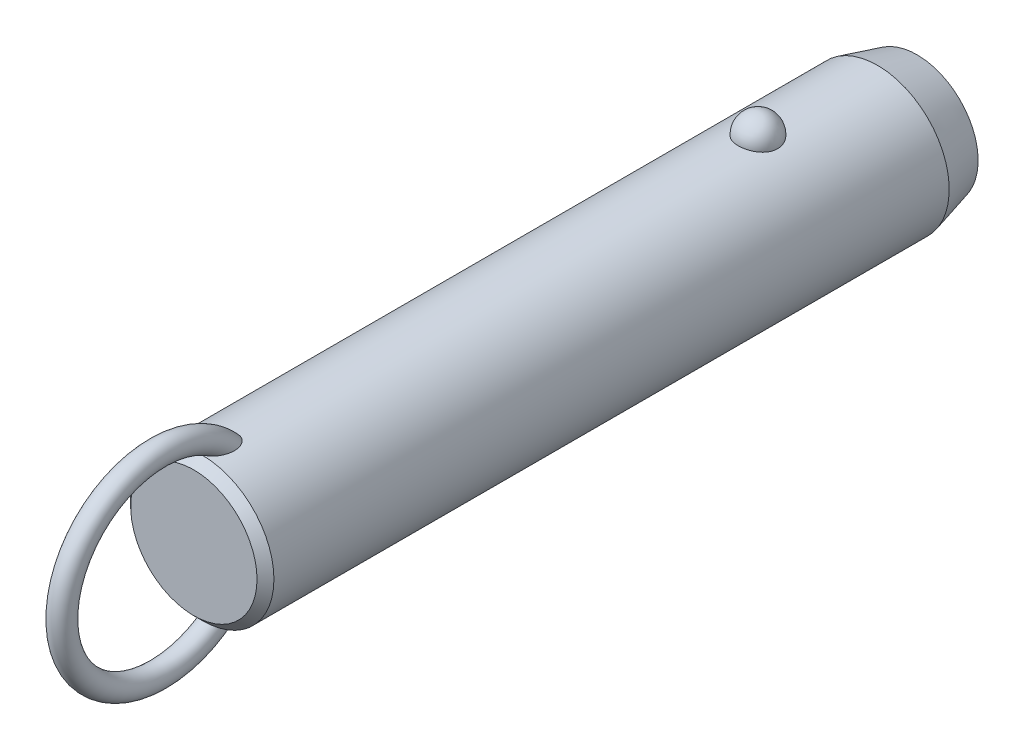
ISO-10303-21;
HEADER;
FILE_DESCRIPTION(('STEP AP214'),'2;1');
FILE_NAME('part.step','',(''),(''),'','','');
FILE_SCHEMA(('AUTOMOTIVE_DESIGN { 1 0 10303 214 1 1 1 1 }'));
ENDSEC;
DATA;
#1=APPLICATION_CONTEXT('core data for automotive mechanical design processes');
#2=APPLICATION_PROTOCOL_DEFINITION('international standard','automotive_design',2000,#1);
#3=PRODUCT_CONTEXT('',#1,'mechanical');
#4=PRODUCT('Part','Part','',(#3));
#5=PRODUCT_RELATED_PRODUCT_CATEGORY('part','',(#4));
#6=PRODUCT_DEFINITION_FORMATION('','',#4);
#7=PRODUCT_DEFINITION_CONTEXT('part definition',#1,'design');
#8=PRODUCT_DEFINITION('design','',#6,#7);
#9=PRODUCT_DEFINITION_SHAPE('','',#8);
#10=(LENGTH_UNIT() NAMED_UNIT(*) SI_UNIT(.MILLI.,.METRE.));
#11=(NAMED_UNIT(*) PLANE_ANGLE_UNIT() SI_UNIT($,.RADIAN.));
#12=(NAMED_UNIT(*) SI_UNIT($,.STERADIAN.) SOLID_ANGLE_UNIT());
#13=UNCERTAINTY_MEASURE_WITH_UNIT(LENGTH_MEASURE(1.E-05),#10,'distance_accuracy_value','');
#14=(GEOMETRIC_REPRESENTATION_CONTEXT(3) GLOBAL_UNCERTAINTY_ASSIGNED_CONTEXT((#13)) GLOBAL_UNIT_ASSIGNED_CONTEXT((#10,
#11,#12)) REPRESENTATION_CONTEXT('',''));
#15=CARTESIAN_POINT('',(0.,0.,0.));
#16=DIRECTION('',(0.,0.,1.));
#17=DIRECTION('',(1.,0.,0.));
#18=AXIS2_PLACEMENT_3D('',#15,#16,#17);
#19=CARTESIAN_POINT('',(0.,0.,83.8));
#20=DIRECTION('',(0.,0.,-1.));
#21=DIRECTION('',(-1.,0.,0.));
#22=AXIS2_PLACEMENT_3D('',#19,#20,#21);
#23=CYLINDRICAL_SURFACE('',#22,12.7);
#24=CARTESIAN_POINT('',(3.46661256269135,12.2177165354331,-3.5));
#25=CARTESIAN_POINT('',(3.4666090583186,12.2177194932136,-3.30432790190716));
#26=CARTESIAN_POINT('',(3.45063567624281,12.2222841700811,-3.10861112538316));
#27=CARTESIAN_POINT('',(3.38712451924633,12.2400345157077,-2.72271899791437));
#28=CARTESIAN_POINT('',(3.33957415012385,12.2532236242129,-2.53254588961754));
#29=CARTESIAN_POINT('',(3.2141234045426,12.286724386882,-2.16324948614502));
#30=CARTESIAN_POINT('',(3.13623639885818,12.3070329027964,-1.98412136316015));
#31=CARTESIAN_POINT('',(2.95205930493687,12.3525018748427,-1.64180592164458));
#32=CARTESIAN_POINT('',(2.84577003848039,12.3776621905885,-1.47861814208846));
#33=CARTESIAN_POINT('',(2.60688050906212,12.4301712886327,-1.17190583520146));
#34=CARTESIAN_POINT('',(2.47415697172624,12.4575299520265,-1.02847897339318));
#35=CARTESIAN_POINT('',(2.18615174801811,12.5112810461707,-0.766177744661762));
#36=CARTESIAN_POINT('',(2.03087002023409,12.5376734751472,-0.64730342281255));
#37=CARTESIAN_POINT('',(1.70237334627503,12.5864761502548,-0.437732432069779));
#38=CARTESIAN_POINT('',(1.52920948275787,12.6088972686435,-0.346958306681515));
#39=CARTESIAN_POINT('',(1.16944170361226,12.6473352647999,-0.195750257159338));
#40=CARTESIAN_POINT('',(0.982839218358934,12.663352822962,-0.135313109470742));
#41=CARTESIAN_POINT('',(0.604961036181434,12.6869706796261,-0.0473241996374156));
#42=CARTESIAN_POINT('',(0.41382314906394,12.6947125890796,-0.0192185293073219));
#43=CARTESIAN_POINT('',(0.0293827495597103,12.7014203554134,0.0051725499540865));
#44=CARTESIAN_POINT('',(-0.163919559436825,12.7003870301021,0.00146092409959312));
#45=CARTESIAN_POINT('',(-0.544374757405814,12.689735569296,-0.0373939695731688));
#46=CARTESIAN_POINT('',(-0.731575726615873,12.6802364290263,-0.0721015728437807));
#47=CARTESIAN_POINT('',(-1.09733277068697,12.6538333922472,-0.171364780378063));
#48=CARTESIAN_POINT('',(-1.27588869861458,12.6369293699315,-0.235920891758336));
#49=CARTESIAN_POINT('',(-1.6204698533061,12.5973946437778,-0.393548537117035));
#50=CARTESIAN_POINT('',(-1.78641865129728,12.5747321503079,-0.486778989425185));
#51=CARTESIAN_POINT('',(-2.10030671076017,12.5261316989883,-0.699110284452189));
#52=CARTESIAN_POINT('',(-2.24824419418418,12.5001934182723,-0.818213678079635));
#53=CARTESIAN_POINT('',(-2.52491489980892,12.4472906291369,-1.08157124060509));
#54=CARTESIAN_POINT('',(-2.65324222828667,12.4203160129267,-1.22624992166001));
#55=CARTESIAN_POINT('',(-2.88410007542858,12.3687509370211,-1.53528325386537));
#56=CARTESIAN_POINT('',(-2.98662883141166,12.3441606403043,-1.69963924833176));
#57=CARTESIAN_POINT('',(-3.16432417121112,12.2998199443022,-2.04548497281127));
#58=CARTESIAN_POINT('',(-3.23917525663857,12.2801261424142,-2.22714424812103));
#59=CARTESIAN_POINT('',(-3.35800573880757,12.248167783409,-2.6009138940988));
#60=CARTESIAN_POINT('',(-3.4019860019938,12.2359030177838,-2.79302397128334));
#61=CARTESIAN_POINT('',(-3.45784812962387,12.2202347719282,-3.18140279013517));
#62=CARTESIAN_POINT('',(-3.46986123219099,12.2167950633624,-3.37765118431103));
#63=CARTESIAN_POINT('',(-3.46186273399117,12.2190638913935,-3.76943689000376));
#64=CARTESIAN_POINT('',(-3.44185196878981,12.2247721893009,-3.96497421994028));
#65=CARTESIAN_POINT('',(-3.37048652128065,12.2446381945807,-4.34881728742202));
#66=CARTESIAN_POINT('',(-3.31928253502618,12.2587552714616,-4.53715319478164));
#67=CARTESIAN_POINT('',(-3.18693461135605,12.2938237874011,-4.90231727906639));
#68=CARTESIAN_POINT('',(-3.1057895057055,12.3147754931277,-5.07914500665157));
#69=CARTESIAN_POINT('',(-2.91506431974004,12.3613125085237,-5.41732059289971));
#70=CARTESIAN_POINT('',(-2.80533587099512,12.3869217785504,-5.57858147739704));
#71=CARTESIAN_POINT('',(-2.560414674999,12.4398525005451,-5.88013283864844));
#72=CARTESIAN_POINT('',(-2.42522099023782,12.4671740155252,-6.02042254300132));
#73=CARTESIAN_POINT('',(-2.1323357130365,12.5205965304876,-6.27662798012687));
#74=CARTESIAN_POINT('',(-1.97456596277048,12.5466928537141,-6.3924554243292));
#75=CARTESIAN_POINT('',(-1.64115839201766,12.5946384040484,-6.59583547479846));
#76=CARTESIAN_POINT('',(-1.46552179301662,12.6164879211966,-6.68339001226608));
#77=CARTESIAN_POINT('',(-1.10356050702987,12.6532533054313,-6.82682153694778));
#78=CARTESIAN_POINT('',(-0.9173913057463,12.6682500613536,-6.8830698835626));
#79=CARTESIAN_POINT('',(-0.537836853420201,12.6900288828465,-6.96386887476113));
#80=CARTESIAN_POINT('',(-0.344452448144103,12.6968119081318,-6.9884232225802));
#81=CARTESIAN_POINT('',(0.0402577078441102,12.7013667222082,-7.00496469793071));
#82=CARTESIAN_POINT('',(0.231556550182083,12.6993008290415,-6.99753844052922));
#83=CARTESIAN_POINT('',(0.610105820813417,12.6867505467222,-6.9516636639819));
#84=CARTESIAN_POINT('',(0.797356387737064,12.6762664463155,-6.913216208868));
#85=CARTESIAN_POINT('',(1.16186657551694,12.6480587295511,-6.80658431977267));
#86=CARTESIAN_POINT('',(1.33915951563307,12.6303611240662,-6.73850666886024));
#87=CARTESIAN_POINT('',(1.67968518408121,12.5896027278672,-6.5745087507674));
#88=CARTESIAN_POINT('',(1.84291705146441,12.5665416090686,-6.47858678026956));
#89=CARTESIAN_POINT('',(2.15340192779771,12.5171072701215,-6.25982455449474));
#90=CARTESIAN_POINT('',(2.30037831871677,12.4906895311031,-6.13660186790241));
#91=CARTESIAN_POINT('',(2.5717412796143,12.4376567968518,-5.86739587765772));
#92=CARTESIAN_POINT('',(2.69612388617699,12.4110417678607,-5.72140858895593));
#93=CARTESIAN_POINT('',(2.92107785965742,12.360051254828,-5.40794137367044));
#94=CARTESIAN_POINT('',(3.02121329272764,12.3357209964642,-5.24014110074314));
#95=CARTESIAN_POINT('',(3.19236291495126,12.2925446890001,-4.88969865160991));
#96=CARTESIAN_POINT('',(3.26338839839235,12.2736965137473,-4.70706226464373));
#97=CARTESIAN_POINT('',(3.36788038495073,12.245404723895,-4.35469510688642));
#98=CARTESIAN_POINT('',(3.40484026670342,12.2351018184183,-4.18605935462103));
#99=CARTESIAN_POINT('',(3.45420764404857,12.2212564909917,-3.84496058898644));
#100=CARTESIAN_POINT('',(3.46661565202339,12.2177139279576,-3.67249765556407));
#101=CARTESIAN_POINT('',(3.46661256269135,12.2177165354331,-3.5));
#102=B_SPLINE_CURVE_WITH_KNOTS('',3,(#24,#25,#26,#27,#28,#29,#30,#31,#32,#33,#34,#35,#36,#37,
#38,#39,#40,#41,#42,#43,#44,#45,#46,#47,#48,#49,#50,#51,#52,#53,#54,#55,#56,#57,#58,#59,#60,#61,
#62,#63,#64,#65,#66,#67,#68,#69,#70,#71,#72,#73,#74,#75,#76,#77,#78,#79,#80,#81,#82,#83,#84,#85,
#86,#87,#88,#89,#90,#91,#92,#93,#94,#95,#96,#97,#98,#99,#100,#101),.UNSPECIFIED.,.T.,.F.,(4,2,2,
2,2,2,2,2,2,2,2,2,2,2,2,2,2,2,2,2,2,2,2,2,2,2,2,2,2,2,2,2,2,2,2,2,2,2,4),(0.,0.586396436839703,
1.17302689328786,1.7593990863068,2.34575431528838,2.93491084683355,3.52406845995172,
4.11158733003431,4.69904375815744,5.2762784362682,5.85345931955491,6.42265312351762,
6.99185659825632,7.56427334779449,8.136746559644,8.71981013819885,9.3029135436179,
9.89247258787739,10.4820150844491,11.0691335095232,11.6562366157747,12.2405256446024,
12.8248374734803,13.412244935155,13.9996740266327,14.5891883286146,15.1786623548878,
15.7609861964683,16.3432419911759,16.9148635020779,17.4864654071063,18.0560241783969,
18.6256177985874,19.2037609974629,19.7820055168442,20.3699810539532,20.957728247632,
21.4746855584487,21.9916320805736),.UNSPECIFIED.);
#103=CARTESIAN_POINT('',(3.46661256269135,12.2177165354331,-3.5));
#104=VERTEX_POINT('',#103);
#105=EDGE_CURVE('E41',#104,#104,#102,.T.);
#106=ORIENTED_EDGE('',*,*,#105,.T.);
#107=EDGE_LOOP('',(#106));
#108=FACE_BOUND('',#107,.T.);
#109=CARTESIAN_POINT('',(0.,0.,95.));
#110=DIRECTION('',(0.,0.,1.));
#111=DIRECTION('',(1.,0.,0.));
#112=AXIS2_PLACEMENT_3D('',#109,#110,#111);
#113=CIRCLE('',#112,12.7);
#114=CARTESIAN_POINT('',(12.7,0.,95.));
#115=VERTEX_POINT('',#114);
#116=EDGE_CURVE('E10',#115,#115,#113,.F.);
#117=ORIENTED_EDGE('',*,*,#116,.T.);
#118=EDGE_LOOP('',(#117));
#119=FACE_BOUND('',#118,.T.);
#120=CARTESIAN_POINT('',(-0.548122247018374,-12.6881662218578,88.7432187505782));
#121=CARTESIAN_POINT('',(-0.64886572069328,-12.6838128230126,88.777926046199));
#122=CARTESIAN_POINT('',(-0.746398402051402,-12.6783867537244,88.8220428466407));
#123=CARTESIAN_POINT('',(-0.93212506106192,-12.666091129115,88.9267647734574));
#124=CARTESIAN_POINT('',(-1.02030388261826,-12.6592192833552,88.987396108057));
#125=CARTESIAN_POINT('',(-1.18487740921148,-12.6448747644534,89.121847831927));
#126=CARTESIAN_POINT('',(-1.26134296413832,-12.637406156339,89.1955825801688));
#127=CARTESIAN_POINT('',(-1.40231200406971,-12.6225412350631,89.3536045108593));
#128=CARTESIAN_POINT('',(-1.46681470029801,-12.6151449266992,89.4378923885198));
#129=CARTESIAN_POINT('',(-1.60714786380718,-12.5981718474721,89.6496577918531));
#130=CARTESIAN_POINT('',(-1.67725126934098,-12.588900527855,89.7809624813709));
#131=CARTESIAN_POINT('',(-1.79536591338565,-12.5725964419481,90.0532471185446));
#132=CARTESIAN_POINT('',(-1.84333535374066,-12.5655679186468,90.1942447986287));
#133=CARTESIAN_POINT('',(-1.93422576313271,-12.5519624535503,90.5376455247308));
#134=CARTESIAN_POINT('',(-1.96788773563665,-12.5466298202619,90.7425578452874));
#135=CARTESIAN_POINT('',(-1.9941399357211,-12.542463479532,91.0517600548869));
#136=CARTESIAN_POINT('',(-1.99883864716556,-12.5417153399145,91.1552987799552));
#137=CARTESIAN_POINT('',(-2.00078003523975,-12.5414074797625,91.3624512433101));
#138=CARTESIAN_POINT('',(-1.99802449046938,-12.5418474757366,91.4660649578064));
#139=CARTESIAN_POINT('',(-1.98336733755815,-12.5441750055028,91.7103207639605));
#140=CARTESIAN_POINT('',(-1.96851430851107,-12.5465291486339,91.850780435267));
#141=CARTESIAN_POINT('',(-1.92707089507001,-12.5529612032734,92.129960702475));
#142=CARTESIAN_POINT('',(-1.900474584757,-12.5570399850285,92.2686803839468));
#143=CARTESIAN_POINT('',(-1.83619120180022,-12.5666008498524,92.5434113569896));
#144=CARTESIAN_POINT('',(-1.79850828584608,-12.57208240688,92.6794236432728));
#145=CARTESIAN_POINT('',(-1.71223796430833,-12.5841228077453,92.9478421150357));
#146=CARTESIAN_POINT('',(-1.6636567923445,-12.5906810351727,93.0802503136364));
#147=CARTESIAN_POINT('',(-1.57804503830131,-12.6016176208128,93.2854887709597));
#148=CARTESIAN_POINT('',(-1.54477252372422,-12.6057501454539,93.3599149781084));
#149=CARTESIAN_POINT('',(-1.47424480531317,-12.6141930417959,93.5068393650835));
#150=CARTESIAN_POINT('',(-1.43699041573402,-12.6185033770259,93.5793379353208));
#151=CARTESIAN_POINT('',(-1.35825795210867,-12.6272207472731,93.7218926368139));
#152=CARTESIAN_POINT('',(-1.31678520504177,-12.6316276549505,93.7919517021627));
#153=CARTESIAN_POINT('',(-1.22917793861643,-12.6404532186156,93.9290705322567));
#154=CARTESIAN_POINT('',(-1.18304514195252,-12.6448718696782,93.9961313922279));
#155=CARTESIAN_POINT('',(-1.07246411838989,-12.6547893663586,94.1438741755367));
#156=CARTESIAN_POINT('',(-1.00642239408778,-12.6602600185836,94.2233844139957));
#157=CARTESIAN_POINT('',(-0.864441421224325,-12.6707460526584,94.3731698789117));
#158=CARTESIAN_POINT('',(-0.788516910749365,-12.6757620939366,94.4434585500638));
#159=CARTESIAN_POINT('',(-0.652215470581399,-12.6833591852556,94.5486801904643));
#160=CARTESIAN_POINT('',(-0.594982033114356,-12.6861973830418,94.5876241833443));
#161=CARTESIAN_POINT('',(-0.475269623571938,-12.6912445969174,94.6564899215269));
#162=CARTESIAN_POINT('',(-0.412800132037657,-12.6934547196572,94.6864275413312));
#163=CARTESIAN_POINT('',(-0.295749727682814,-12.6966636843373,94.7297565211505));
#164=CARTESIAN_POINT('',(-0.241949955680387,-12.6978134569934,94.7452188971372));
#165=CARTESIAN_POINT('',(-0.132508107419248,-12.6994261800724,94.7668845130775));
#166=CARTESIAN_POINT('',(-0.0768679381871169,-12.6998898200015,94.7730970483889));
#167=CARTESIAN_POINT('',(0.0347696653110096,-12.7000752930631,94.7755838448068));
#168=CARTESIAN_POINT('',(0.0907676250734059,-12.6997954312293,94.7718353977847));
#169=CARTESIAN_POINT('',(0.201283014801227,-12.6985255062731,94.7547883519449));
#170=CARTESIAN_POINT('',(0.255799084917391,-12.6975348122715,94.7414812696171));
#171=CARTESIAN_POINT('',(0.376042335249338,-12.6946091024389,94.7020379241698));
#172=CARTESIAN_POINT('',(0.440950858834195,-12.6924943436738,94.6734492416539));
#173=CARTESIAN_POINT('',(0.565350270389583,-12.6875639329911,94.6063234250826));
#174=CARTESIAN_POINT('',(0.624828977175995,-12.6847467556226,94.5677646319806));
#175=CARTESIAN_POINT('',(0.774116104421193,-12.6767252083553,94.456949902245));
#176=CARTESIAN_POINT('',(0.859449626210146,-12.6711344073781,94.3787605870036));
#177=CARTESIAN_POINT('',(1.01789440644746,-12.6593922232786,94.210943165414));
#178=CARTESIAN_POINT('',(1.09096902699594,-12.653239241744,94.1212821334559));
#179=CARTESIAN_POINT('',(1.22268793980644,-12.6411674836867,93.9402658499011));
#180=CARTESIAN_POINT('',(1.28193986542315,-12.6352572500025,93.849345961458));
#181=CARTESIAN_POINT('',(1.39259777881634,-12.6235401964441,93.6627929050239));
#182=CARTESIAN_POINT('',(1.44399707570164,-12.6177334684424,93.5671558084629));
#183=CARTESIAN_POINT('',(1.53972870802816,-12.6064093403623,93.3722738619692));
#184=CARTESIAN_POINT('',(1.58405262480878,-12.6008922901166,93.2730248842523));
#185=CARTESIAN_POINT('',(1.66600705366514,-12.5903187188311,93.0717727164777));
#186=CARTESIAN_POINT('',(1.70363651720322,-12.5852622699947,92.9697690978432));
#187=CARTESIAN_POINT('',(1.7754537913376,-12.5753406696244,92.7543580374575));
#188=CARTESIAN_POINT('',(1.80903453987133,-12.5705328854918,92.6407454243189));
#189=CARTESIAN_POINT('',(1.86844163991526,-12.5618400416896,92.4114575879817));
#190=CARTESIAN_POINT('',(1.89426665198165,-12.5579551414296,92.2957820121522));
#191=CARTESIAN_POINT('',(1.93785464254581,-12.5513030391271,92.0630072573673));
#192=CARTESIAN_POINT('',(1.95562640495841,-12.5485346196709,91.9459097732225));
#193=CARTESIAN_POINT('',(1.98264463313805,-12.5442934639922,91.7107473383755));
#194=CARTESIAN_POINT('',(1.99189298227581,-12.5428204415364,91.5926826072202));
#195=CARTESIAN_POINT('',(2.00416068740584,-12.540871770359,91.2806225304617));
#196=CARTESIAN_POINT('',(1.99944433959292,-12.541631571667,91.086229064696));
#197=CARTESIAN_POINT('',(1.96113755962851,-12.5476846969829,90.7003095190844));
#198=CARTESIAN_POINT('',(1.92758341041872,-12.5529723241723,90.5087801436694));
#199=CARTESIAN_POINT('',(1.83934342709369,-12.5661532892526,90.1822728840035));
#200=CARTESIAN_POINT('',(1.79215440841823,-12.5730485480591,90.0452499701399));
#201=CARTESIAN_POINT('',(1.67676242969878,-12.588958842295,89.7804459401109));
#202=CARTESIAN_POINT('',(1.60859050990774,-12.597970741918,89.6526515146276));
#203=CARTESIAN_POINT('',(1.46583832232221,-12.6152829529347,89.4358006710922));
#204=CARTESIAN_POINT('',(1.39525727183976,-12.6233659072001,89.3441050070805));
#205=CARTESIAN_POINT('',(1.23992594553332,-12.6395676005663,89.1734854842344));
#206=CARTESIAN_POINT('',(1.15517932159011,-12.6476863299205,89.0945583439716));
#207=CARTESIAN_POINT('',(0.971995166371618,-12.6630846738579,88.9526438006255));
#208=CARTESIAN_POINT('',(0.873456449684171,-12.6703572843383,88.8897849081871));
#209=CARTESIAN_POINT('',(0.665847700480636,-12.6829569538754,88.7844870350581));
#210=CARTESIAN_POINT('',(0.556784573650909,-12.688285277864,88.7420347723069));
#211=CARTESIAN_POINT('',(0.347338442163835,-12.6956226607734,88.6844434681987));
#212=CARTESIAN_POINT('',(0.247759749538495,-12.6979816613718,88.6663996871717));
#213=CARTESIAN_POINT('',(0.0470218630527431,-12.7003077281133,88.648600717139));
#214=CARTESIAN_POINT('',(-0.0541350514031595,-12.7002779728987,88.6488212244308));
#215=CARTESIAN_POINT('',(-0.221414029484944,-12.6982482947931,88.6643639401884));
#216=CARTESIAN_POINT('',(-0.288055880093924,-12.6969033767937,88.6746662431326));
#217=CARTESIAN_POINT('',(-0.419599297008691,-12.6932369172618,88.7031348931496));
#218=CARTESIAN_POINT('',(-0.484501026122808,-12.6909154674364,88.7213005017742));
#219=CARTESIAN_POINT('',(-0.548122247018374,-12.6881662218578,88.7432187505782));
#220=B_SPLINE_CURVE_WITH_KNOTS('',3,(#120,#121,#122,#123,#124,#125,#126,#127,#128,#129,#130,
#131,#132,#133,#134,#135,#136,#137,#138,#139,#140,#141,#142,#143,#144,#145,#146,#147,#148,#149,
#150,#151,#152,#153,#154,#155,#156,#157,#158,#159,#160,#161,#162,#163,#164,#165,#166,#167,#168,
#169,#170,#171,#172,#173,#174,#175,#176,#177,#178,#179,#180,#181,#182,#183,#184,#185,#186,#187,
#188,#189,#190,#191,#192,#193,#194,#195,#196,#197,#198,#199,#200,#201,#202,#203,#204,#205,#206,
#207,#208,#209,#210,#211,#212,#213,#214,#215,#216,#217,#218,#219),.UNSPECIFIED.,.T.,.F.,(4,2,2,
2,2,2,2,2,2,2,2,2,2,2,2,2,2,2,2,2,2,2,2,2,2,2,2,2,2,2,2,2,2,2,2,2,2,2,2,2,2,2,2,2,2,2,2,2,2,4),
(0.,0.319642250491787,0.639794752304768,0.957927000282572,1.27608021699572,1.72100165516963,
2.16675988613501,2.78630021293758,3.09705782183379,3.40774128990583,3.83096358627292,
4.25439969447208,4.67767724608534,5.1007133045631,5.34550297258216,5.59024267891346,
5.83467707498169,6.07902143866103,6.38891080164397,6.69834321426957,6.90560910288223,
7.11250749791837,7.279773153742,7.44687060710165,7.6143493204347,7.78197685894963,
7.99365544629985,8.20579780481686,8.55147335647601,8.89816429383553,9.22375138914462,
9.54961437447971,9.87586224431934,10.202161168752,10.5575872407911,10.9130746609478,
11.2681734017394,11.6231936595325,12.2046601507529,12.7853961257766,13.219164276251,
13.6522938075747,13.9989174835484,14.3454519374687,14.6946768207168,15.0436740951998,
15.3457513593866,15.6474266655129,15.8493051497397,16.0511646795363),.UNSPECIFIED.);
#221=CARTESIAN_POINT('',(-0.548122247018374,-12.6881662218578,88.7432187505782));
#222=VERTEX_POINT('',#221);
#223=EDGE_CURVE('E59',#222,#222,#220,.T.);
#224=ORIENTED_EDGE('',*,*,#223,.T.);
#225=EDGE_LOOP('',(#224));
#226=FACE_BOUND('',#225,.T.);
#227=CARTESIAN_POINT('',(-0.548122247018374,12.6881662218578,88.7432187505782));
#228=CARTESIAN_POINT('',(-0.459436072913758,12.6919968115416,88.712673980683));
#229=CARTESIAN_POINT('',(-0.368189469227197,12.6949996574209,88.6893913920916));
#230=CARTESIAN_POINT('',(-0.183024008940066,12.6990186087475,88.6584062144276));
#231=CARTESIAN_POINT('',(-0.0891049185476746,12.7000345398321,88.6507049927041));
#232=CARTESIAN_POINT('',(0.0987147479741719,12.6999636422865,88.6512455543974));
#233=CARTESIAN_POINT('',(0.192615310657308,12.6988761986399,88.6594920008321));
#234=CARTESIAN_POINT('',(0.377658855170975,12.6947211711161,88.6915515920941));
#235=CARTESIAN_POINT('',(0.468801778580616,12.6916535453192,88.7153650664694));
#236=CARTESIAN_POINT('',(0.645809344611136,12.6838788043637,88.7774565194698));
#237=CARTESIAN_POINT('',(0.731679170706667,12.6791733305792,88.815720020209));
#238=CARTESIAN_POINT('',(0.896315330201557,12.6686004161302,88.905120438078));
#239=CARTESIAN_POINT('',(0.975080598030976,12.6627328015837,88.9562592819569));
#240=CARTESIAN_POINT('',(1.12963655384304,12.6499161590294,89.0736782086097));
#241=CARTESIAN_POINT('',(1.20478673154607,12.6429194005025,89.1407929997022));
#242=CARTESIAN_POINT('',(1.34448241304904,12.6288282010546,89.2852250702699));
#243=CARTESIAN_POINT('',(1.40902173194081,12.621733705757,89.3625482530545));
#244=CARTESIAN_POINT('',(1.55208211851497,12.6050877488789,89.5592475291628));
#245=CARTESIAN_POINT('',(1.62510490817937,12.5957546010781,89.6826540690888));
#246=CARTESIAN_POINT('',(1.7501904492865,12.5789823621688,89.9397690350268));
#247=CARTESIAN_POINT('',(1.80221377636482,12.5715468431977,90.073496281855));
#248=CARTESIAN_POINT('',(1.90309965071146,12.5567434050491,90.3983516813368));
#249=CARTESIAN_POINT('',(1.94342317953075,12.5504515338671,90.5921611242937));
#250=CARTESIAN_POINT('',(1.99332997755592,12.5426147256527,90.9837881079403));
#251=CARTESIAN_POINT('',(2.00285305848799,12.5410790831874,91.1816127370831));
#252=CARTESIAN_POINT('',(1.99678999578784,12.5420407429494,91.5166427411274));
#253=CARTESIAN_POINT('',(1.98794117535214,12.5434564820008,91.6540428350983));
#254=CARTESIAN_POINT('',(1.95865119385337,12.5480641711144,91.9276394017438));
#255=CARTESIAN_POINT('',(1.9382043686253,12.5512569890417,92.0638352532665));
#256=CARTESIAN_POINT('',(1.88647896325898,12.5591352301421,92.3342493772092));
#257=CARTESIAN_POINT('',(1.85518800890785,12.5638223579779,92.4684652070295));
#258=CARTESIAN_POINT('',(1.78217886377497,12.5743868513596,92.7339362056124));
#259=CARTESIAN_POINT('',(1.74046509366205,12.5802637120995,92.8651926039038));
#260=CARTESIAN_POINT('',(1.66024095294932,12.5910571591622,93.0860855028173));
#261=CARTESIAN_POINT('',(1.62434772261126,12.5957535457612,93.1766904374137));
#262=CARTESIAN_POINT('',(1.54709009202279,12.6054762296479,93.3555125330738));
#263=CARTESIAN_POINT('',(1.50572681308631,12.6105024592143,93.4437301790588));
#264=CARTESIAN_POINT('',(1.41728020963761,12.620748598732,93.6169321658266));
#265=CARTESIAN_POINT('',(1.37021377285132,12.625967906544,93.7019251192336));
#266=CARTESIAN_POINT('',(1.2696962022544,12.6364721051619,93.8680072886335));
#267=CARTESIAN_POINT('',(1.21624929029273,12.6417569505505,93.9490990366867));
#268=CARTESIAN_POINT('',(1.10304413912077,12.6521331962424,94.1047027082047));
#269=CARTESIAN_POINT('',(1.04340936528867,12.657226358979,94.1793033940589));
#270=CARTESIAN_POINT('',(0.915919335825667,12.6670906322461,94.321324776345));
#271=CARTESIAN_POINT('',(0.848064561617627,12.6718617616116,94.3887458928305));
#272=CARTESIAN_POINT('',(0.717035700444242,12.67987711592,94.5006247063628));
#273=CARTESIAN_POINT('',(0.655526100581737,12.6832377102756,94.5469970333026));
#274=CARTESIAN_POINT('',(0.525985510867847,12.6892676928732,94.6296195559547));
#275=CARTESIAN_POINT('',(0.457969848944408,12.6919386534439,94.6658927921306));
#276=CARTESIAN_POINT('',(0.334859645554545,12.695691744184,94.7166572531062));
#277=CARTESIAN_POINT('',(0.281116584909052,12.6970073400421,94.7343733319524));
#278=CARTESIAN_POINT('',(0.17142581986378,12.6989609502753,94.7606429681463));
#279=CARTESIAN_POINT('',(0.11548082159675,12.699599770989,94.7692074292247));
#280=CARTESIAN_POINT('',(0.00272618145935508,12.7001251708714,94.7762531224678));
#281=CARTESIAN_POINT('',(-0.0540859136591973,12.7000089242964,94.7746964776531));
#282=CARTESIAN_POINT('',(-0.166544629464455,12.6990328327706,94.7616005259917));
#283=CARTESIAN_POINT('',(-0.222190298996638,12.6981724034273,94.7500533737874));
#284=CARTESIAN_POINT('',(-0.342018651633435,12.695562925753,94.7149128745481));
#285=CARTESIAN_POINT('',(-0.405606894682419,12.6936676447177,94.6893322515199));
#286=CARTESIAN_POINT('',(-0.527815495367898,12.6891754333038,94.6283111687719));
#287=CARTESIAN_POINT('',(-0.586425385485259,12.6865770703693,94.5928505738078));
#288=CARTESIAN_POINT('',(-0.731842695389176,12.6792129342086,94.4914960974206));
#289=CARTESIAN_POINT('',(-0.814709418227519,12.6740767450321,94.4200395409));
#290=CARTESIAN_POINT('',(-0.969101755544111,12.6632083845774,94.2658900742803));
#291=CARTESIAN_POINT('',(-1.04059564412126,12.6574746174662,94.1831668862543));
#292=CARTESIAN_POINT('',(-1.16981116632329,12.6461638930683,94.0158096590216));
#293=CARTESIAN_POINT('',(-1.22811369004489,12.6405994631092,93.9316166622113));
#294=CARTESIAN_POINT('',(-1.33743405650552,12.6295007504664,93.7585791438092));
#295=CARTESIAN_POINT('',(-1.38844577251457,12.6239664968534,93.6697307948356));
#296=CARTESIAN_POINT('',(-1.48400702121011,12.6130898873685,93.488389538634));
#297=CARTESIAN_POINT('',(-1.52854232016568,12.6077479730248,93.3958891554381));
#298=CARTESIAN_POINT('',(-1.6115011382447,12.5974127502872,93.2081607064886));
#299=CARTESIAN_POINT('',(-1.64992317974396,12.5924195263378,93.1129319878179));
#300=CARTESIAN_POINT('',(-1.73468589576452,12.581070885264,92.8828936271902));
#301=CARTESIAN_POINT('',(-1.77831261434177,12.5749388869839,92.7470661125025));
#302=CARTESIAN_POINT('',(-1.85439734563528,12.5639437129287,92.4722128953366));
#303=CARTESIAN_POINT('',(-1.88684994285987,12.5590811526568,92.3331856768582));
#304=CARTESIAN_POINT('',(-1.9400848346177,12.550968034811,92.0530923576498));
#305=CARTESIAN_POINT('',(-1.96088706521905,12.5477147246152,91.9120301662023));
#306=CARTESIAN_POINT('',(-1.99000539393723,12.5431291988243,91.6286689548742));
#307=CARTESIAN_POINT('',(-1.99832911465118,12.5417958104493,91.4863707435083));
#308=CARTESIAN_POINT('',(-2.00166624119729,12.5412674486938,91.1576271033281));
#309=CARTESIAN_POINT('',(-1.99178843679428,12.5428579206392,90.971088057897));
#310=CARTESIAN_POINT('',(-1.9445518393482,12.5502731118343,90.6016240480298));
#311=CARTESIAN_POINT('',(-1.90724032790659,12.5560905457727,90.4186934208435));
#312=CARTESIAN_POINT('',(-1.81330718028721,12.5699462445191,90.1048488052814));
#313=CARTESIAN_POINT('',(-1.76338820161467,12.5771273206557,89.9719105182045));
#314=CARTESIAN_POINT('',(-1.64305018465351,12.593414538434,89.7156813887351));
#315=CARTESIAN_POINT('',(-1.57265346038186,12.6025185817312,89.592380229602));
#316=CARTESIAN_POINT('',(-1.42634956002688,12.6198178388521,89.3835648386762));
#317=CARTESIAN_POINT('',(-1.35423772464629,12.6278405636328,89.2953846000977));
#318=CARTESIAN_POINT('',(-1.19645664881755,12.6437632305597,89.1321079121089));
#319=CARTESIAN_POINT('',(-1.11080536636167,12.6516633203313,89.0569944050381));
#320=CARTESIAN_POINT('',(-0.947219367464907,12.6648319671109,88.9378114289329));
#321=CARTESIAN_POINT('',(-0.871624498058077,12.670300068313,88.8905414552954));
#322=CARTESIAN_POINT('',(-0.714161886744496,12.6801492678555,88.8077413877));
#323=CARTESIAN_POINT('',(-0.632295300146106,12.684530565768,88.7722091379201));
#324=CARTESIAN_POINT('',(-0.548122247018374,12.6881662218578,88.7432187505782));
#325=B_SPLINE_CURVE_WITH_KNOTS('',3,(#227,#228,#229,#230,#231,#232,#233,#234,#235,#236,#237,
#238,#239,#240,#241,#242,#243,#244,#245,#246,#247,#248,#249,#250,#251,#252,#253,#254,#255,#256,
#257,#258,#259,#260,#261,#262,#263,#264,#265,#266,#267,#268,#269,#270,#271,#272,#273,#274,#275,
#276,#277,#278,#279,#280,#281,#282,#283,#284,#285,#286,#287,#288,#289,#290,#291,#292,#293,#294,
#295,#296,#297,#298,#299,#300,#301,#302,#303,#304,#305,#306,#307,#308,#309,#310,#311,#312,#313,
#314,#315,#316,#317,#318,#319,#320,#321,#322,#323,#324),.UNSPECIFIED.,.T.,.F.,(4,2,2,2,2,2,2,2,
2,2,2,2,2,2,2,2,2,2,2,2,2,2,2,2,2,2,2,2,2,2,2,2,2,2,2,2,2,2,2,2,2,2,2,2,2,2,2,2,4),(0.,
0.281328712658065,0.562682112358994,0.844117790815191,1.12555942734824,1.40671982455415,
1.68792232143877,1.98972294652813,2.29169886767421,2.72039860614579,3.14989948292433,
3.74084916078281,4.33295293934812,4.74554109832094,5.15833092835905,5.57159335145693,
5.98468079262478,6.27722775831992,6.56971484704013,6.86135609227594,7.15280542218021,
7.43927407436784,7.72572595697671,7.9563586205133,8.18646071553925,8.35559393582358,
8.52452541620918,8.69408946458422,8.86378678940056,9.06834348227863,9.27332014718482,
9.60010414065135,9.92778432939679,10.2350252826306,10.5425229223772,10.8506864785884,
11.1589244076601,11.5867893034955,12.0148612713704,12.4421984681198,12.8692745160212,
13.4279365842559,13.9856380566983,14.4107062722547,14.8353130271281,15.1765567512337,
15.5173516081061,15.7844129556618,16.051425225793),.UNSPECIFIED.);
#326=CARTESIAN_POINT('',(-0.548122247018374,12.6881662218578,88.7432187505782));
#327=VERTEX_POINT('',#326);
#328=EDGE_CURVE('E67',#327,#327,#325,.T.);
#329=ORIENTED_EDGE('',*,*,#328,.T.);
#330=EDGE_LOOP('',(#329));
#331=FACE_BOUND('',#330,.T.);
#332=CARTESIAN_POINT('',(0.,0.,-24.6999999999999));
#333=DIRECTION('',(0.,0.,-1.));
#334=DIRECTION('',(-1.,0.,0.));
#335=AXIS2_PLACEMENT_3D('',#332,#333,#334);
#336=CIRCLE('',#335,12.7);
#337=CARTESIAN_POINT('',(-12.7,0.,-24.6999999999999));
#338=VERTEX_POINT('',#337);
#339=EDGE_CURVE('E56',#338,#338,#336,.F.);
#340=ORIENTED_EDGE('',*,*,#339,.T.);
#341=EDGE_LOOP('',(#340));
#342=FACE_BOUND('',#341,.T.);
#343=ADVANCED_FACE('F37',(#108,#119,#226,#331,#342),#23,.T.);
#344=CARTESIAN_POINT('',(0.,0.,-31.7));
#345=DIRECTION('',(0.,0.,-1.));
#346=DIRECTION('',(-1.,0.,0.));
#347=AXIS2_PLACEMENT_3D('',#344,#345,#346);
#348=PLANE('',#347);
#349=CARTESIAN_POINT('',(0.,0.,-31.7));
#350=DIRECTION('',(0.,0.,-1.));
#351=DIRECTION('',(-1.,0.,0.));
#352=AXIS2_PLACEMENT_3D('',#349,#350,#351);
#353=CIRCLE('',#352,10.8243556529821);
#354=CARTESIAN_POINT('',(-10.8243556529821,0.,-31.7));
#355=VERTEX_POINT('',#354);
#356=EDGE_CURVE('E66',#355,#355,#353,.T.);
#357=ORIENTED_EDGE('',*,*,#356,.T.);
#358=EDGE_LOOP('',(#357));
#359=FACE_BOUND('',#358,.T.);
#360=ADVANCED_FACE('F85',(#359),#348,.T.);
#361=CARTESIAN_POINT('',(0.,0.,-31.7));
#362=DIRECTION('',(0.,0.,1.));
#363=DIRECTION('',(1.,0.,0.));
#364=AXIS2_PLACEMENT_3D('',#361,#362,#363);
#365=CONICAL_SURFACE('',#364,10.8243556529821,0.261799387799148);
#366=ORIENTED_EDGE('',*,*,#339,.F.);
#367=EDGE_LOOP('',(#366));
#368=FACE_BOUND('',#367,.T.);
#369=ORIENTED_EDGE('',*,*,#356,.F.);
#370=EDGE_LOOP('',(#369));
#371=FACE_BOUND('',#370,.T.);
#372=ADVANCED_FACE('F83',(#368,#371),#365,.T.);
#373=CARTESIAN_POINT('',(0.,0.,96.5));
#374=DIRECTION('',(0.,0.,1.));
#375=DIRECTION('',(1.,0.,0.));
#376=AXIS2_PLACEMENT_3D('',#373,#374,#375);
#377=PLANE('',#376);
#378=CARTESIAN_POINT('',(0.,0.,96.5));
#379=DIRECTION('',(0.,0.,1.));
#380=DIRECTION('',(1.,0.,0.));
#381=AXIS2_PLACEMENT_3D('',#378,#379,#380);
#382=CIRCLE('',#381,11.2);
#383=CARTESIAN_POINT('',(11.2,0.,96.5));
#384=VERTEX_POINT('',#383);
#385=EDGE_CURVE('E50',#384,#384,#382,.T.);
#386=ORIENTED_EDGE('',*,*,#385,.T.);
#387=EDGE_LOOP('',(#386));
#388=FACE_BOUND('',#387,.T.);
#389=ADVANCED_FACE('F77',(#388),#377,.T.);
#390=CARTESIAN_POINT('',(0.,0.,102.85));
#391=DIRECTION('',(1.,0.,0.));
#392=DIRECTION('',(0.,0.,-1.));
#393=AXIS2_PLACEMENT_3D('',#390,#391,#392);
#394=TOROIDAL_SURFACE('',#393,17.05,2.);
#395=ORIENTED_EDGE('',*,*,#328,.F.);
#396=EDGE_LOOP('',(#395));
#397=FACE_BOUND('',#396,.T.);
#398=ORIENTED_EDGE('',*,*,#223,.F.);
#399=EDGE_LOOP('',(#398));
#400=FACE_BOUND('',#399,.T.);
#401=ADVANCED_FACE('F73',(#397,#400),#394,.T.);
#402=CARTESIAN_POINT('',(0.,0.,96.5));
#403=DIRECTION('',(0.,0.,-1.));
#404=DIRECTION('',(-1.,0.,0.));
#405=AXIS2_PLACEMENT_3D('',#402,#403,#404);
#406=CONICAL_SURFACE('',#405,11.2,0.785398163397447);
#407=ORIENTED_EDGE('',*,*,#116,.F.);
#408=EDGE_LOOP('',(#407));
#409=FACE_BOUND('',#408,.T.);
#410=ORIENTED_EDGE('',*,*,#385,.F.);
#411=EDGE_LOOP('',(#410));
#412=FACE_BOUND('',#411,.T.);
#413=ADVANCED_FACE('F39',(#409,#412),#406,.T.);
#414=CARTESIAN_POINT('',(0.,12.7,-3.5));
#415=DIRECTION('',(0.,1.,0.));
#416=DIRECTION('',(0.,0.,-1.));
#417=AXIS2_PLACEMENT_3D('',#414,#415,#416);
#418=SPHERICAL_SURFACE('',#417,3.5);
#419=ORIENTED_EDGE('',*,*,#105,.F.);
#420=EDGE_LOOP('',(#419));
#421=FACE_BOUND('',#420,.T.);
#422=ADVANCED_FACE('F79',(#421),#418,.T.);
#423=CLOSED_SHELL('',(#343,#360,#372,#389,#401,#413,#422));
#424=MANIFOLD_SOLID_BREP('B2',#423);
#425=ADVANCED_BREP_SHAPE_REPRESENTATION('',(#18,#424),#14);
#426=SHAPE_DEFINITION_REPRESENTATION(#9,#425);
ENDSEC;
END-ISO-10303-21;
